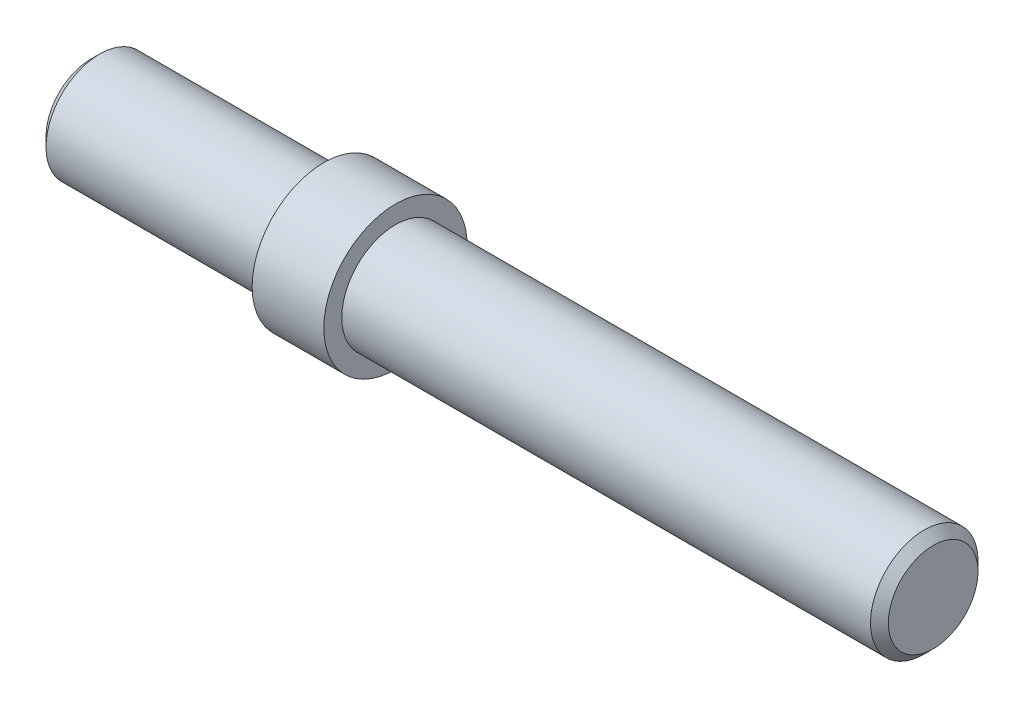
ISO-10303-21;
HEADER;
FILE_DESCRIPTION(('STEP AP214'),'2;1');
FILE_NAME('part.step','',(''),(''),'','','');
FILE_SCHEMA(('AUTOMOTIVE_DESIGN { 1 0 10303 214 1 1 1 1 }'));
ENDSEC;
DATA;
#1=APPLICATION_CONTEXT('core data for automotive mechanical design processes');
#2=APPLICATION_PROTOCOL_DEFINITION('international standard','automotive_design',2000,#1);
#3=PRODUCT_CONTEXT('',#1,'mechanical');
#4=PRODUCT('Part','Part','',(#3));
#5=PRODUCT_RELATED_PRODUCT_CATEGORY('part','',(#4));
#6=PRODUCT_DEFINITION_FORMATION('','',#4);
#7=PRODUCT_DEFINITION_CONTEXT('part definition',#1,'design');
#8=PRODUCT_DEFINITION('design','',#6,#7);
#9=PRODUCT_DEFINITION_SHAPE('','',#8);
#10=(LENGTH_UNIT() NAMED_UNIT(*) SI_UNIT(.MILLI.,.METRE.));
#11=(NAMED_UNIT(*) PLANE_ANGLE_UNIT() SI_UNIT($,.RADIAN.));
#12=(NAMED_UNIT(*) SI_UNIT($,.STERADIAN.) SOLID_ANGLE_UNIT());
#13=UNCERTAINTY_MEASURE_WITH_UNIT(LENGTH_MEASURE(1.E-05),#10,'distance_accuracy_value','');
#14=(GEOMETRIC_REPRESENTATION_CONTEXT(3) GLOBAL_UNCERTAINTY_ASSIGNED_CONTEXT((#13)) GLOBAL_UNIT_ASSIGNED_CONTEXT((#10,
#11,#12)) REPRESENTATION_CONTEXT('',''));
#15=CARTESIAN_POINT('',(0.,0.,0.));
#16=DIRECTION('',(0.,0.,1.));
#17=DIRECTION('',(1.,0.,0.));
#18=AXIS2_PLACEMENT_3D('',#15,#16,#17);
#19=CARTESIAN_POINT('',(0.,0.,0.));
#20=DIRECTION('',(1.,0.,0.));
#21=DIRECTION('',(0.,0.,-1.));
#22=AXIS2_PLACEMENT_3D('',#19,#20,#21);
#23=PLANE('',#22);
#24=CARTESIAN_POINT('',(0.,0.,0.));
#25=DIRECTION('',(1.,0.,0.));
#26=DIRECTION('',(0.,0.,-1.));
#27=AXIS2_PLACEMENT_3D('',#24,#25,#26);
#28=CIRCLE('',#27,2.5);
#29=CARTESIAN_POINT('',(0.,0.,-2.5));
#30=VERTEX_POINT('',#29);
#31=EDGE_CURVE('E28',#30,#30,#28,.F.);
#32=ORIENTED_EDGE('',*,*,#31,.T.);
#33=EDGE_LOOP('',(#32));
#34=FACE_BOUND('',#33,.T.);
#35=ADVANCED_FACE('F22',(#34),#23,.F.);
#36=CARTESIAN_POINT('',(0.,0.,0.));
#37=DIRECTION('',(-1.,0.,0.));
#38=DIRECTION('',(0.,0.,1.));
#39=AXIS2_PLACEMENT_3D('',#36,#37,#38);
#40=CYLINDRICAL_SURFACE('',#39,3.);
#41=CARTESIAN_POINT('',(0.500000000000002,0.,0.));
#42=DIRECTION('',(1.,0.,0.));
#43=DIRECTION('',(0.,0.,-1.));
#44=AXIS2_PLACEMENT_3D('',#41,#42,#43);
#45=CIRCLE('',#44,3.);
#46=CARTESIAN_POINT('',(0.500000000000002,0.,-3.));
#47=VERTEX_POINT('',#46);
#48=EDGE_CURVE('E10',#47,#47,#45,.T.);
#49=ORIENTED_EDGE('',*,*,#48,.T.);
#50=EDGE_LOOP('',(#49));
#51=FACE_BOUND('',#50,.T.);
#52=CARTESIAN_POINT('',(13.,0.,0.));
#53=DIRECTION('',(-1.,0.,0.));
#54=DIRECTION('',(0.,0.,1.));
#55=AXIS2_PLACEMENT_3D('',#52,#53,#54);
#56=CIRCLE('',#55,3.);
#57=CARTESIAN_POINT('',(13.,0.,3.));
#58=VERTEX_POINT('',#57);
#59=EDGE_CURVE('E41',#58,#58,#56,.T.);
#60=ORIENTED_EDGE('',*,*,#59,.T.);
#61=EDGE_LOOP('',(#60));
#62=FACE_BOUND('',#61,.T.);
#63=ADVANCED_FACE('F72',(#51,#62),#40,.T.);
#64=CARTESIAN_POINT('',(13.,3.,0.));
#65=DIRECTION('',(1.,0.,0.));
#66=DIRECTION('',(0.,0.,-1.));
#67=AXIS2_PLACEMENT_3D('',#64,#65,#66);
#68=PLANE('',#67);
#69=ORIENTED_EDGE('',*,*,#59,.F.);
#70=EDGE_LOOP('',(#69));
#71=FACE_BOUND('',#70,.T.);
#72=CARTESIAN_POINT('',(13.,0.,0.));
#73=DIRECTION('',(-1.,0.,0.));
#74=DIRECTION('',(0.,0.,1.));
#75=AXIS2_PLACEMENT_3D('',#72,#73,#74);
#76=CIRCLE('',#75,4.);
#77=CARTESIAN_POINT('',(13.,0.,4.));
#78=VERTEX_POINT('',#77);
#79=EDGE_CURVE('E44',#78,#78,#76,.T.);
#80=ORIENTED_EDGE('',*,*,#79,.T.);
#81=EDGE_LOOP('',(#80));
#82=FACE_BOUND('',#81,.T.);
#83=ADVANCED_FACE('F76',(#71,#82),#68,.F.);
#84=CARTESIAN_POINT('',(0.,0.,0.));
#85=DIRECTION('',(-1.,0.,0.));
#86=DIRECTION('',(0.,0.,1.));
#87=AXIS2_PLACEMENT_3D('',#84,#85,#86);
#88=CYLINDRICAL_SURFACE('',#87,4.);
#89=ORIENTED_EDGE('',*,*,#79,.F.);
#90=EDGE_LOOP('',(#89));
#91=FACE_BOUND('',#90,.T.);
#92=CARTESIAN_POINT('',(17.,0.,0.));
#93=DIRECTION('',(-1.,0.,0.));
#94=DIRECTION('',(0.,0.,1.));
#95=AXIS2_PLACEMENT_3D('',#92,#93,#94);
#96=CIRCLE('',#95,4.);
#97=CARTESIAN_POINT('',(17.,0.,4.));
#98=VERTEX_POINT('',#97);
#99=EDGE_CURVE('E47',#98,#98,#96,.T.);
#100=ORIENTED_EDGE('',*,*,#99,.T.);
#101=EDGE_LOOP('',(#100));
#102=FACE_BOUND('',#101,.T.);
#103=ADVANCED_FACE('F68',(#91,#102),#88,.T.);
#104=CARTESIAN_POINT('',(17.,4.,0.));
#105=DIRECTION('',(-1.,0.,0.));
#106=DIRECTION('',(0.,0.,1.));
#107=AXIS2_PLACEMENT_3D('',#104,#105,#106);
#108=PLANE('',#107);
#109=ORIENTED_EDGE('',*,*,#99,.F.);
#110=EDGE_LOOP('',(#109));
#111=FACE_BOUND('',#110,.T.);
#112=CARTESIAN_POINT('',(17.,0.,0.));
#113=DIRECTION('',(-1.,0.,0.));
#114=DIRECTION('',(0.,0.,1.));
#115=AXIS2_PLACEMENT_3D('',#112,#113,#114);
#116=CIRCLE('',#115,3.);
#117=CARTESIAN_POINT('',(17.,0.,3.));
#118=VERTEX_POINT('',#117);
#119=EDGE_CURVE('E50',#118,#118,#116,.T.);
#120=ORIENTED_EDGE('',*,*,#119,.T.);
#121=EDGE_LOOP('',(#120));
#122=FACE_BOUND('',#121,.T.);
#123=ADVANCED_FACE('F54',(#111,#122),#108,.F.);
#124=CARTESIAN_POINT('',(0.,0.,0.));
#125=DIRECTION('',(-1.,0.,0.));
#126=DIRECTION('',(0.,0.,1.));
#127=AXIS2_PLACEMENT_3D('',#124,#125,#126);
#128=CYLINDRICAL_SURFACE('',#127,3.);
#129=CARTESIAN_POINT('',(46.5,0.,0.));
#130=DIRECTION('',(-1.,0.,0.));
#131=DIRECTION('',(0.,0.,1.));
#132=AXIS2_PLACEMENT_3D('',#129,#130,#131);
#133=CIRCLE('',#132,3.);
#134=CARTESIAN_POINT('',(46.5,0.,3.));
#135=VERTEX_POINT('',#134);
#136=EDGE_CURVE('E36',#135,#135,#133,.T.);
#137=ORIENTED_EDGE('',*,*,#136,.T.);
#138=EDGE_LOOP('',(#137));
#139=FACE_BOUND('',#138,.T.);
#140=ORIENTED_EDGE('',*,*,#119,.F.);
#141=EDGE_LOOP('',(#140));
#142=FACE_BOUND('',#141,.T.);
#143=ADVANCED_FACE('F56',(#139,#142),#128,.T.);
#144=CARTESIAN_POINT('',(47.,3.,0.));
#145=DIRECTION('',(-1.,0.,0.));
#146=DIRECTION('',(0.,0.,1.));
#147=AXIS2_PLACEMENT_3D('',#144,#145,#146);
#148=PLANE('',#147);
#149=CARTESIAN_POINT('',(47.,0.,0.));
#150=DIRECTION('',(-1.,0.,0.));
#151=DIRECTION('',(0.,0.,1.));
#152=AXIS2_PLACEMENT_3D('',#149,#150,#151);
#153=CIRCLE('',#152,2.5);
#154=CARTESIAN_POINT('',(47.,0.,2.5));
#155=VERTEX_POINT('',#154);
#156=EDGE_CURVE('E32',#155,#155,#153,.F.);
#157=ORIENTED_EDGE('',*,*,#156,.T.);
#158=EDGE_LOOP('',(#157));
#159=FACE_BOUND('',#158,.T.);
#160=ADVANCED_FACE('F58',(#159),#148,.F.);
#161=CARTESIAN_POINT('',(46.5,0.,0.));
#162=DIRECTION('',(-1.,0.,0.));
#163=DIRECTION('',(0.,0.,1.));
#164=AXIS2_PLACEMENT_3D('',#161,#162,#163);
#165=CONICAL_SURFACE('',#164,3.,0.785398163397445);
#166=ORIENTED_EDGE('',*,*,#156,.F.);
#167=EDGE_LOOP('',(#166));
#168=FACE_BOUND('',#167,.T.);
#169=ORIENTED_EDGE('',*,*,#136,.F.);
#170=EDGE_LOOP('',(#169));
#171=FACE_BOUND('',#170,.T.);
#172=ADVANCED_FACE('F65',(#168,#171),#165,.T.);
#173=CARTESIAN_POINT('',(0.,0.,0.));
#174=DIRECTION('',(1.,0.,0.));
#175=DIRECTION('',(0.,0.,-1.));
#176=AXIS2_PLACEMENT_3D('',#173,#174,#175);
#177=CONICAL_SURFACE('',#176,2.5,0.785398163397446);
#178=ORIENTED_EDGE('',*,*,#48,.F.);
#179=EDGE_LOOP('',(#178));
#180=FACE_BOUND('',#179,.T.);
#181=ORIENTED_EDGE('',*,*,#31,.F.);
#182=EDGE_LOOP('',(#181));
#183=FACE_BOUND('',#182,.T.);
#184=ADVANCED_FACE('F111',(#180,#183),#177,.T.);
#185=CLOSED_SHELL('',(#35,#63,#83,#103,#123,#143,#160,#172,#184));
#186=MANIFOLD_SOLID_BREP('B2',#185);
#187=ADVANCED_BREP_SHAPE_REPRESENTATION('',(#18,#186),#14);
#188=SHAPE_DEFINITION_REPRESENTATION(#9,#187);
ENDSEC;
END-ISO-10303-21;
